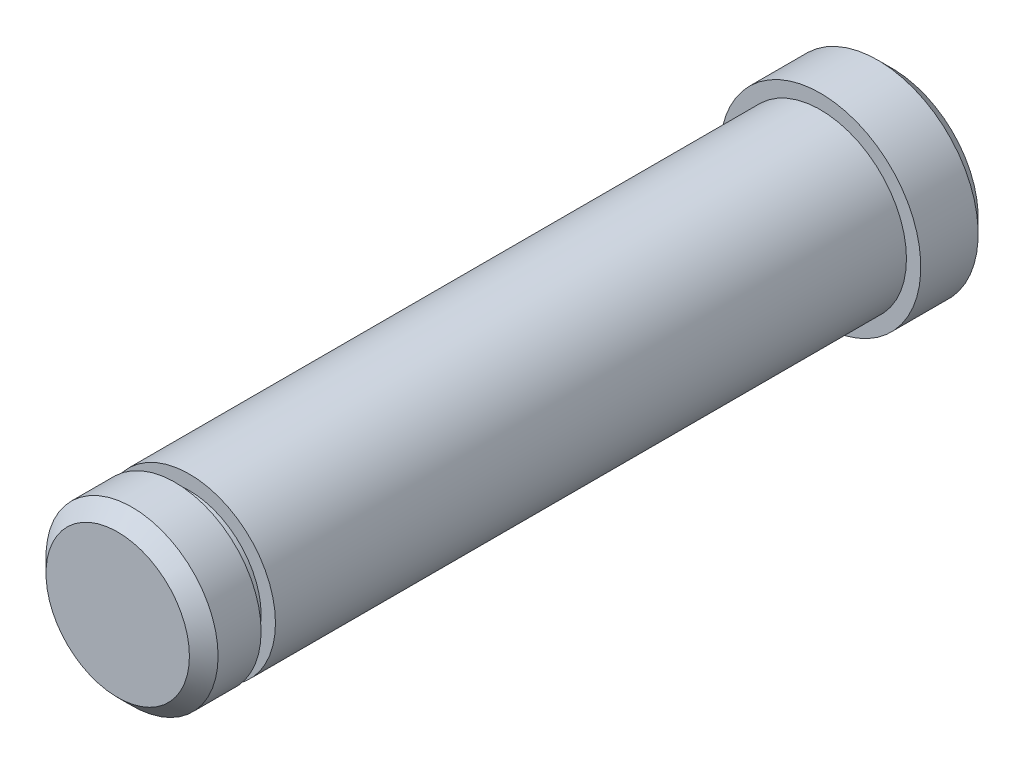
from build123d import *

# Parameters (mm, degrees)
SKETCH1_R           = 6
BOSS_EXTRUDE1_DEPTH = 44
SKETCH2_R           = 7
BOSS_EXTRUDE2_DEPTH = 5
SKETCH3_R           = 5
BOSS_EXTRUDE3_DEPTH = 1
SKETCH4_R           = 6
BOSS_EXTRUDE4_DEPTH = 4
CHAMFER1_SIZE       = 1


with BuildPart() as part:
    # Sketch1 → Boss-Extrude1 (new body)
    with BuildSketch(Plane.XY):
        Circle(SKETCH1_R)
    extrude(amount=BOSS_EXTRUDE1_DEPTH)

    # Sketch2 → Boss-Extrude2 (add)
    with BuildSketch(Plane(origin=(0, 0, 0), x_dir=(-1, 0, 0), z_dir=(0, 0, -1))):
        Circle(SKETCH2_R)
    extrude(amount=BOSS_EXTRUDE2_DEPTH)

    # Sketch3 → Boss-Extrude3 (add)
    with BuildSketch(Plane.XY.offset(44)):
        Circle(SKETCH3_R)
    extrude(amount=BOSS_EXTRUDE3_DEPTH)

    # Sketch4 → Boss-Extrude4 (add)
    with BuildSketch(Plane.XY.offset(45)):
        Circle(SKETCH4_R)
    extrude(amount=BOSS_EXTRUDE4_DEPTH)

    # Chamfer1
    chamfer1_edges = [part.edges().sort_by_distance(p)[0] for p in [
        (-6, 0, 49),
        (7, 0, -5),
    ]]
    chamfer(chamfer1_edges, length=CHAMFER1_SIZE)


solid = part.part
